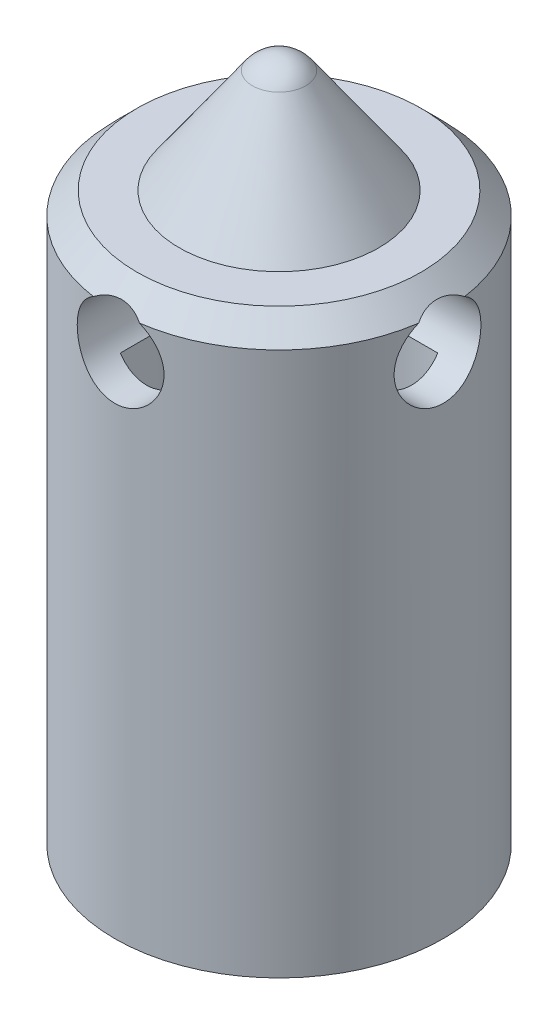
ISO-10303-21;
HEADER;
FILE_DESCRIPTION(('STEP AP214'),'2;1');
FILE_NAME('part.step','',(''),(''),'','','');
FILE_SCHEMA(('AUTOMOTIVE_DESIGN { 1 0 10303 214 1 1 1 1 }'));
ENDSEC;
DATA;
#1=APPLICATION_CONTEXT('core data for automotive mechanical design processes');
#2=APPLICATION_PROTOCOL_DEFINITION('international standard','automotive_design',2000,#1);
#3=PRODUCT_CONTEXT('',#1,'mechanical');
#4=PRODUCT('Part','Part','',(#3));
#5=PRODUCT_RELATED_PRODUCT_CATEGORY('part','',(#4));
#6=PRODUCT_DEFINITION_FORMATION('','',#4);
#7=PRODUCT_DEFINITION_CONTEXT('part definition',#1,'design');
#8=PRODUCT_DEFINITION('design','',#6,#7);
#9=PRODUCT_DEFINITION_SHAPE('','',#8);
#10=(LENGTH_UNIT() NAMED_UNIT(*) SI_UNIT(.MILLI.,.METRE.));
#11=(NAMED_UNIT(*) PLANE_ANGLE_UNIT() SI_UNIT($,.RADIAN.));
#12=(NAMED_UNIT(*) SI_UNIT($,.STERADIAN.) SOLID_ANGLE_UNIT());
#13=UNCERTAINTY_MEASURE_WITH_UNIT(LENGTH_MEASURE(1.E-05),#10,'distance_accuracy_value','');
#14=(GEOMETRIC_REPRESENTATION_CONTEXT(3) GLOBAL_UNCERTAINTY_ASSIGNED_CONTEXT((#13)) GLOBAL_UNIT_ASSIGNED_CONTEXT((#10,
#11,#12)) REPRESENTATION_CONTEXT('',''));
#15=CARTESIAN_POINT('',(0.,0.,0.));
#16=DIRECTION('',(0.,0.,1.));
#17=DIRECTION('',(1.,0.,0.));
#18=AXIS2_PLACEMENT_3D('',#15,#16,#17);
#19=CARTESIAN_POINT('',(2.4257,8.6868,0.));
#20=DIRECTION('',(0.,-1.,0.));
#21=DIRECTION('',(0.,0.,-1.));
#22=AXIS2_PLACEMENT_3D('',#19,#20,#21);
#23=PLANE('',#22);
#24=DIRECTION('',(1.,0.,0.));
#25=VECTOR('',#24,1.);
#26=CARTESIAN_POINT('',(-5.,8.6868,-0.537354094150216));
#27=LINE('',#26,#25);
#28=CARTESIAN_POINT('',(0.537354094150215,8.6868,-0.537354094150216));
#29=VERTEX_POINT('',#28);
#30=CARTESIAN_POINT('',(2.36543253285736,8.6868,-0.537354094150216));
#31=VERTEX_POINT('',#30);
#32=EDGE_CURVE('E283',#29,#31,#27,.T.);
#33=ORIENTED_EDGE('',*,*,#32,.F.);
#34=DIRECTION('',(0.,0.,1.));
#35=VECTOR('',#34,1.);
#36=CARTESIAN_POINT('',(0.537354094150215,8.6868,-5.));
#37=LINE('',#36,#35);
#38=CARTESIAN_POINT('',(0.537354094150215,8.6868,-2.36543253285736));
#39=VERTEX_POINT('',#38);
#40=EDGE_CURVE('E152',#39,#29,#37,.T.);
#41=ORIENTED_EDGE('',*,*,#40,.F.);
#42=CARTESIAN_POINT('',(0.,8.6868,0.));
#43=DIRECTION('',(0.,1.,0.));
#44=DIRECTION('',(0.,0.,1.));
#45=AXIS2_PLACEMENT_3D('',#42,#43,#44);
#46=CIRCLE('',#45,2.4257);
#47=EDGE_CURVE('E192',#31,#39,#46,.T.);
#48=ORIENTED_EDGE('',*,*,#47,.F.);
#49=EDGE_LOOP('',(#33,#41,#48));
#50=FACE_BOUND('',#49,.T.);
#51=ADVANCED_FACE('F54',(#50),#23,.T.);
#52=DIRECTION('',(1.,0.,0.));
#53=VECTOR('',#52,1.);
#54=CARTESIAN_POINT('',(-5.,8.6868,-0.537354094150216));
#55=LINE('',#54,#53);
#56=CARTESIAN_POINT('',(-2.36543253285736,8.6868,-0.537354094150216));
#57=VERTEX_POINT('',#56);
#58=CARTESIAN_POINT('',(-0.537354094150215,8.6868,-0.537354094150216));
#59=VERTEX_POINT('',#58);
#60=EDGE_CURVE('E138',#57,#59,#55,.T.);
#61=ORIENTED_EDGE('',*,*,#60,.F.);
#62=CARTESIAN_POINT('',(-0.537354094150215,8.6868,-2.36543253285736));
#63=VERTEX_POINT('',#62);
#64=EDGE_CURVE('E193',#63,#57,#46,.T.);
#65=ORIENTED_EDGE('',*,*,#64,.F.);
#66=DIRECTION('',(0.,0.,1.));
#67=VECTOR('',#66,1.);
#68=CARTESIAN_POINT('',(-0.537354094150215,8.6868,-5.));
#69=LINE('',#68,#67);
#70=EDGE_CURVE('E167',#59,#63,#69,.F.);
#71=ORIENTED_EDGE('',*,*,#70,.F.);
#72=EDGE_LOOP('',(#61,#65,#71));
#73=FACE_BOUND('',#72,.T.);
#74=ADVANCED_FACE('F320',(#73),#23,.T.);
#75=CARTESIAN_POINT('',(0.,9.271,-5.));
#76=DIRECTION('',(0.,0.,1.));
#77=DIRECTION('',(1.,0.,0.));
#78=AXIS2_PLACEMENT_3D('',#75,#76,#77);
#79=CYLINDRICAL_SURFACE('',#78,0.793749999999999);
#80=CARTESIAN_POINT('',(-0.439700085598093,9.93183500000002,2.98358910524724));
#81=CARTESIAN_POINT('',(-0.410241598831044,9.95148901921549,2.96807129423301));
#82=CARTESIAN_POINT('',(-0.378793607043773,9.96951383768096,2.95411745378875));
#83=CARTESIAN_POINT('',(-0.312571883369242,10.0015312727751,2.92965766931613));
#84=CARTESIAN_POINT('',(-0.277790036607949,10.0155137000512,2.9191604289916));
#85=CARTESIAN_POINT('',(-0.205584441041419,10.0386058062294,2.90198539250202));
#86=CARTESIAN_POINT('',(-0.168152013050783,10.0476985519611,2.89532086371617));
#87=CARTESIAN_POINT('',(-0.0919301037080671,10.0603517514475,2.88608176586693));
#88=CARTESIAN_POINT('',(-0.0531429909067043,10.063921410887,2.88350039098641));
#89=CARTESIAN_POINT('',(0.022494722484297,10.0652840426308,2.88251306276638));
#90=CARTESIAN_POINT('',(0.0593374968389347,10.0633768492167,2.88389039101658));
#91=CARTESIAN_POINT('',(0.13210736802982,10.0545372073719,2.89032273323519));
#92=CARTESIAN_POINT('',(0.168033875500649,10.0476016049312,2.89538005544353));
#93=CARTESIAN_POINT('',(0.237631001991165,10.0291923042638,2.90896738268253));
#94=CARTESIAN_POINT('',(0.271319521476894,10.0177614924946,2.91746459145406));
#95=CARTESIAN_POINT('',(0.3360064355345,9.9909734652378,2.93768725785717));
#96=CARTESIAN_POINT('',(0.367007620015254,9.97562038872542,2.94940931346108));
#97=CARTESIAN_POINT('',(0.411261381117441,9.9501171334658,2.96921862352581));
#98=CARTESIAN_POINT('',(0.425700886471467,9.94115539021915,2.97623132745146));
#99=CARTESIAN_POINT('',(0.439700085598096,9.93183500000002,2.98358910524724));
#100=B_SPLINE_CURVE_WITH_KNOTS('',3,(#80,#81,#82,#83,#84,#85,#86,#87,#88,#89,#90,#91,#92,#93,
#94,#95,#96,#97,#98,#99),.UNSPECIFIED.,.F.,.F.,(4,2,2,2,2,2,2,2,2,4),(0.,0.115971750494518,
0.232233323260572,0.348894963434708,0.465361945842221,0.575576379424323,0.685860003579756,
0.795116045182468,0.904257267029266,0.959351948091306),.UNSPECIFIED.);
#101=CARTESIAN_POINT('',(-0.420684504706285,9.94410000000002,2.97394303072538));
#102=VERTEX_POINT('',#101);
#103=CARTESIAN_POINT('',(0.420684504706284,9.94410000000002,2.97394303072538));
#104=VERTEX_POINT('',#103);
#105=EDGE_CURVE('E202',#102,#104,#100,.T.);
#106=ORIENTED_EDGE('',*,*,#105,.F.);
#107=CARTESIAN_POINT('',(0.420684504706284,9.94410000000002,2.97394303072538));
#108=CARTESIAN_POINT('',(0.458832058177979,9.92029056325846,2.96855665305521));
#109=CARTESIAN_POINT('',(0.494863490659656,9.89323433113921,2.96270051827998));
#110=CARTESIAN_POINT('',(0.561846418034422,9.83346833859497,2.95072611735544));
#111=CARTESIAN_POINT('',(0.592797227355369,9.80075781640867,2.94460781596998));
#112=CARTESIAN_POINT('',(0.648772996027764,9.73051445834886,2.93278563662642));
#113=CARTESIAN_POINT('',(0.673795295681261,9.69297946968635,2.92708194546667));
#114=CARTESIAN_POINT('',(0.717171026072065,9.6141146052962,2.91675781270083));
#115=CARTESIAN_POINT('',(0.735527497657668,9.57278647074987,2.91213687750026));
#116=CARTESIAN_POINT('',(0.764836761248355,9.48792691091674,2.90457675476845));
#117=CARTESIAN_POINT('',(0.775866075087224,9.44442353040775,2.90162023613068));
#118=CARTESIAN_POINT('',(0.79044397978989,9.3560896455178,2.89768344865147));
#119=CARTESIAN_POINT('',(0.793993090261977,9.31125923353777,2.89670304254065));
#120=CARTESIAN_POINT('',(0.79348903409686,9.22307643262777,2.89684086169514));
#121=CARTESIAN_POINT('',(0.789674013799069,9.17972237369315,2.89789334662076));
#122=CARTESIAN_POINT('',(0.77504515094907,9.09430340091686,2.9018397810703));
#123=CARTESIAN_POINT('',(0.764231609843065,9.05223843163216,2.90473365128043));
#124=CARTESIAN_POINT('',(0.735975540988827,8.9705942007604,2.91202050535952));
#125=CARTESIAN_POINT('',(0.718540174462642,8.93101230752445,2.91641186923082));
#126=CARTESIAN_POINT('',(0.677552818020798,8.85528893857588,2.92620524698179));
#127=CARTESIAN_POINT('',(0.653999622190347,8.8191481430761,2.93160746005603));
#128=CARTESIAN_POINT('',(0.600579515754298,8.75012927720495,2.94302292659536));
#129=CARTESIAN_POINT('',(0.570538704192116,8.71738800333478,2.94904997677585));
#130=CARTESIAN_POINT('',(0.50540072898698,8.65734570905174,2.96090812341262));
#131=CARTESIAN_POINT('',(0.470303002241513,8.6300452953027,2.96673919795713));
#132=CARTESIAN_POINT('',(0.395370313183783,8.58125322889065,2.97765819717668));
#133=CARTESIAN_POINT('',(0.355470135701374,8.55985857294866,2.98273314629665));
#134=CARTESIAN_POINT('',(0.272482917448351,8.52411837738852,2.99145511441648));
#135=CARTESIAN_POINT('',(0.229396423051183,8.50977163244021,2.99510237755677));
#136=CARTESIAN_POINT('',(0.142289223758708,8.48885314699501,3.00048776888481));
#137=CARTESIAN_POINT('',(0.0983114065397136,8.48211359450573,3.00226703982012));
#138=CARTESIAN_POINT('',(0.00981567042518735,8.47607303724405,3.003859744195));
#139=CARTESIAN_POINT('',(-0.0347021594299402,8.47677082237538,3.00367349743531));
#140=CARTESIAN_POINT('',(-0.121846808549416,8.48546658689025,3.00138636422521));
#141=CARTESIAN_POINT('',(-0.16449315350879,8.4932832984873,2.99933302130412));
#142=CARTESIAN_POINT('',(-0.247845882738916,8.51570242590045,2.99359839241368));
#143=CARTESIAN_POINT('',(-0.288552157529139,8.530305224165,2.98991701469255));
#144=CARTESIAN_POINT('',(-0.367334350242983,8.56602215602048,2.98126908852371));
#145=CARTESIAN_POINT('',(-0.405380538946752,8.58719877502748,2.97629028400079));
#146=CARTESIAN_POINT('',(-0.477441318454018,8.63541431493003,2.96558450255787));
#147=CARTESIAN_POINT('',(-0.511455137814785,8.662454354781,2.95985738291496));
#148=CARTESIAN_POINT('',(-0.575567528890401,8.722592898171,2.94807230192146));
#149=CARTESIAN_POINT('',(-0.605517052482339,8.75584954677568,2.94200957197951));
#150=CARTESIAN_POINT('',(-0.659449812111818,8.82697628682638,2.9303927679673));
#151=CARTESIAN_POINT('',(-0.683432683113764,8.86484666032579,2.92483872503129));
#152=CARTESIAN_POINT('',(-0.724861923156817,8.94444424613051,2.91484934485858));
#153=CARTESIAN_POINT('',(-0.742268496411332,8.98619309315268,2.91042087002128));
#154=CARTESIAN_POINT('',(-0.769767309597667,9.07217070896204,2.9032697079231));
#155=CARTESIAN_POINT('',(-0.779861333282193,9.11639887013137,2.90054660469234));
#156=CARTESIAN_POINT('',(-0.792193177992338,9.20468799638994,2.89720253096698));
#157=CARTESIAN_POINT('',(-0.794652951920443,9.24871574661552,2.89652219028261));
#158=CARTESIAN_POINT('',(-0.792257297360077,9.33655214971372,2.89717837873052));
#159=CARTESIAN_POINT('',(-0.787402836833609,9.38036083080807,2.89851464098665));
#160=CARTESIAN_POINT('',(-0.77071367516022,9.46566192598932,2.9029958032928));
#161=CARTESIAN_POINT('',(-0.759012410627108,9.50718244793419,2.90610610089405));
#162=CARTESIAN_POINT('',(-0.729106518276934,9.58768128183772,2.91375235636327));
#163=CARTESIAN_POINT('',(-0.710899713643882,9.62665873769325,2.91828879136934));
#164=CARTESIAN_POINT('',(-0.668043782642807,9.70189833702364,2.92839962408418));
#165=CARTESIAN_POINT('',(-0.643261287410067,9.73808152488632,2.93399472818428));
#166=CARTESIAN_POINT('',(-0.588130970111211,9.8058313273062,2.94553956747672));
#167=CARTESIAN_POINT('',(-0.557788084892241,9.83740199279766,2.95148898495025));
#168=CARTESIAN_POINT('',(-0.508776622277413,9.8806387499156,2.96019151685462));
#169=CARTESIAN_POINT('',(-0.491886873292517,9.89434551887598,2.96305096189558));
#170=CARTESIAN_POINT('',(-0.457055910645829,9.9203146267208,2.96862316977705));
#171=CARTESIAN_POINT('',(-0.439116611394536,9.93257947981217,2.97133618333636));
#172=CARTESIAN_POINT('',(-0.420684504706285,9.94410000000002,2.97394303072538));
#173=B_SPLINE_CURVE_WITH_KNOTS('',3,(#107,#108,#109,#110,#111,#112,#113,#114,#115,#116,#117,
#118,#119,#120,#121,#122,#123,#124,#125,#126,#127,#128,#129,#130,#131,#132,#133,#134,#135,#136,
#137,#138,#139,#140,#141,#142,#143,#144,#145,#146,#147,#148,#149,#150,#151,#152,#153,#154,#155,
#156,#157,#158,#159,#160,#161,#162,#163,#164,#165,#166,#167,#168,#169,#170,#171,#172),
.UNSPECIFIED.,.F.,.F.,(4,2,2,2,2,2,2,2,2,2,2,2,2,2,2,2,2,2,2,2,2,2,2,2,2,2,2,2,2,2,2,2,4),(0.,
0.135680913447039,0.271380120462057,0.407140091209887,0.54283805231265,0.677095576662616,
0.811343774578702,0.9413231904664,1.07129700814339,1.20113066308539,1.33098992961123,
1.46489653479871,1.59881806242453,1.73482346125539,1.87080559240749,2.00372550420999,
2.13662378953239,2.26622993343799,2.39584338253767,2.5267286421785,2.65763890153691,
2.79249794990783,2.92736524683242,3.06303608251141,3.19867381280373,3.33032929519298,
3.46196735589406,3.59112157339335,3.72031904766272,3.8523691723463,3.98430261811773,
4.05005604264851,4.11569305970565),.UNSPECIFIED.);
#174=EDGE_CURVE('E194',#104,#102,#173,.T.);
#175=ORIENTED_EDGE('',*,*,#174,.F.);
#176=EDGE_LOOP('',(#106,#175));
#177=FACE_BOUND('',#176,.T.);
#178=CARTESIAN_POINT('',(-0.537354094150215,8.6868,2.36543253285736));
#179=VERTEX_POINT('',#178);
#180=CARTESIAN_POINT('',(-0.537354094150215,8.6868,0.537354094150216));
#181=VERTEX_POINT('',#180);
#182=EDGE_CURVE('E158',#179,#181,#69,.F.);
#183=ORIENTED_EDGE('',*,*,#182,.T.);
#184=CARTESIAN_POINT('',(0.,9.271,0.));
#185=DIRECTION('',(0.707106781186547,0.,0.707106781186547));
#186=DIRECTION('',(-0.707106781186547,0.,0.707106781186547));
#187=AXIS2_PLACEMENT_3D('',#184,#185,#186);
#188=ELLIPSE('',#187,1.12253201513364,0.793749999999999);
#189=CARTESIAN_POINT('',(0.,10.06475,0.));
#190=VERTEX_POINT('',#189);
#191=EDGE_CURVE('E12',#181,#190,#188,.F.);
#192=ORIENTED_EDGE('',*,*,#191,.T.);
#193=CARTESIAN_POINT('',(0.,9.271,0.));
#194=DIRECTION('',(-0.707106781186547,0.,0.707106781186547));
#195=DIRECTION('',(0.707106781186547,0.,0.707106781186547));
#196=AXIS2_PLACEMENT_3D('',#193,#194,#195);
#197=ELLIPSE('',#196,1.12253201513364,0.793749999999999);
#198=CARTESIAN_POINT('',(0.537354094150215,8.6868,0.537354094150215));
#199=VERTEX_POINT('',#198);
#200=EDGE_CURVE('E142',#190,#199,#197,.F.);
#201=ORIENTED_EDGE('',*,*,#200,.T.);
#202=CARTESIAN_POINT('',(0.537354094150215,8.6868,2.36543253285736));
#203=VERTEX_POINT('',#202);
#204=EDGE_CURVE('E165',#199,#203,#37,.T.);
#205=ORIENTED_EDGE('',*,*,#204,.T.);
#206=CARTESIAN_POINT('',(0.537354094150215,8.6868,2.36543253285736));
#207=CARTESIAN_POINT('',(0.505018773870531,8.65701865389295,2.37280151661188));
#208=CARTESIAN_POINT('',(0.470140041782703,8.62993647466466,2.38000610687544));
#209=CARTESIAN_POINT('',(0.396210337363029,8.5818029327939,2.39341184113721));
#210=CARTESIAN_POINT('',(0.357154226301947,8.56075911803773,2.39961172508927));
#211=CARTESIAN_POINT('',(0.275803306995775,8.52538339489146,2.41032036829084));
#212=CARTESIAN_POINT('',(0.233503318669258,8.51106249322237,2.41482635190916));
#213=CARTESIAN_POINT('',(0.146971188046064,8.48970572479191,2.42163114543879));
#214=CARTESIAN_POINT('',(0.102741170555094,8.48266204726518,2.42393232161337));
#215=CARTESIAN_POINT('',(0.0151361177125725,8.47621972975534,2.42603561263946));
#216=CARTESIAN_POINT('',(-0.0282191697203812,8.47657718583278,2.42591745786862));
#217=CARTESIAN_POINT('',(-0.114243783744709,8.4843280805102,2.42339035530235));
#218=CARTESIAN_POINT('',(-0.156912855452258,8.49172407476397,2.42098057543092));
#219=CARTESIAN_POINT('',(-0.239711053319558,8.51312073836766,2.41417937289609));
#220=CARTESIAN_POINT('',(-0.279868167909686,8.52702339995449,2.40981739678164));
#221=CARTESIAN_POINT('',(-0.357281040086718,8.56094869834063,2.3995612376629));
#222=CARTESIAN_POINT('',(-0.394538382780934,8.58096796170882,2.3936678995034));
#223=CARTESIAN_POINT('',(-0.44899833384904,8.61605139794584,2.38386245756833));
#224=CARTESIAN_POINT('',(-0.467549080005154,8.6291651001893,2.38028441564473));
#225=CARTESIAN_POINT('',(-0.50340029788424,8.6568836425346,2.37296071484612));
#226=CARTESIAN_POINT('',(-0.520703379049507,8.67148520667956,2.36921543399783));
#227=CARTESIAN_POINT('',(-0.537354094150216,8.6868,2.36543253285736));
#228=B_SPLINE_CURVE_WITH_KNOTS('',3,(#206,#207,#208,#209,#210,#211,#212,#213,#214,#215,#216,
#217,#218,#219,#220,#221,#222,#223,#224,#225,#226,#227),.UNSPECIFIED.,.F.,.F.,(4,2,2,2,2,2,2,2,
2,2,4),(0.,0.133597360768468,0.267360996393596,0.40134287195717,0.535180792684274,
0.664615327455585,0.794096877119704,0.921687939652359,1.04920875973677,1.11812937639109,
1.18690139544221),.UNSPECIFIED.);
#229=EDGE_CURVE('E221',#203,#179,#228,.T.);
#230=ORIENTED_EDGE('',*,*,#229,.T.);
#231=EDGE_LOOP('',(#183,#192,#201,#205,#230));
#232=FACE_BOUND('',#231,.T.);
#233=ADVANCED_FACE('F155',(#177,#232),#79,.F.);
#234=DIRECTION('',(1.,0.,0.));
#235=VECTOR('',#234,1.);
#236=CARTESIAN_POINT('',(-5.,8.6868,0.537354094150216));
#237=LINE('',#236,#235);
#238=CARTESIAN_POINT('',(2.36543253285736,8.6868,0.537354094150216));
#239=VERTEX_POINT('',#238);
#240=EDGE_CURVE('E149',#239,#199,#237,.F.);
#241=ORIENTED_EDGE('',*,*,#240,.F.);
#242=EDGE_CURVE('E189',#203,#239,#46,.T.);
#243=ORIENTED_EDGE('',*,*,#242,.F.);
#244=ORIENTED_EDGE('',*,*,#204,.F.);
#245=EDGE_LOOP('',(#241,#243,#244));
#246=FACE_BOUND('',#245,.T.);
#247=ADVANCED_FACE('F318',(#246),#23,.T.);
#248=CARTESIAN_POINT('',(0.,0.,0.));
#249=DIRECTION('',(0.,1.,0.));
#250=DIRECTION('',(0.,0.,1.));
#251=AXIS2_PLACEMENT_3D('',#248,#249,#250);
#252=PLANE('',#251);
#253=CARTESIAN_POINT('',(0.,0.,0.));
#254=DIRECTION('',(0.,1.,0.));
#255=DIRECTION('',(0.,0.,1.));
#256=AXIS2_PLACEMENT_3D('',#253,#254,#255);
#257=CIRCLE('',#256,3.00355);
#258=CARTESIAN_POINT('',(0.,0.,3.00355));
#259=VERTEX_POINT('',#258);
#260=EDGE_CURVE('E168',#259,#259,#257,.T.);
#261=ORIENTED_EDGE('',*,*,#260,.F.);
#262=EDGE_LOOP('',(#261));
#263=FACE_BOUND('',#262,.T.);
#264=CARTESIAN_POINT('',(0.,0.,0.));
#265=DIRECTION('',(0.,1.,0.));
#266=DIRECTION('',(0.,0.,1.));
#267=AXIS2_PLACEMENT_3D('',#264,#265,#266);
#268=CIRCLE('',#267,2.4257);
#269=CARTESIAN_POINT('',(0.,0.,2.4257));
#270=VERTEX_POINT('',#269);
#271=EDGE_CURVE('E186',#270,#270,#268,.T.);
#272=ORIENTED_EDGE('',*,*,#271,.T.);
#273=EDGE_LOOP('',(#272));
#274=FACE_BOUND('',#273,.T.);
#275=ADVANCED_FACE('F56',(#263,#274),#252,.F.);
#276=CARTESIAN_POINT('',(0.,13.6030493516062,0.));
#277=DIRECTION('',(0.,1.,0.));
#278=DIRECTION('',(0.,0.,1.));
#279=AXIS2_PLACEMENT_3D('',#276,#277,#278);
#280=CYLINDRICAL_SURFACE('',#279,3.00355);
#281=CARTESIAN_POINT('',(0.,9.94410000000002,0.));
#282=DIRECTION('',(0.,1.,0.));
#283=DIRECTION('',(0.,0.,1.));
#284=AXIS2_PLACEMENT_3D('',#281,#282,#283);
#285=CIRCLE('',#284,3.00355);
#286=CARTESIAN_POINT('',(-2.97394303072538,9.94410000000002,0.420684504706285));
#287=VERTEX_POINT('',#286);
#288=EDGE_CURVE('E179',#287,#102,#285,.T.);
#289=ORIENTED_EDGE('',*,*,#288,.F.);
#290=CARTESIAN_POINT('',(-2.97394303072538,9.94410000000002,0.420684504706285));
#291=CARTESIAN_POINT('',(-2.96855665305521,9.92029056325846,0.458832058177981));
#292=CARTESIAN_POINT('',(-2.96270051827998,9.89323433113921,0.494863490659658));
#293=CARTESIAN_POINT('',(-2.95072611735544,9.83346833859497,0.561846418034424));
#294=CARTESIAN_POINT('',(-2.94460781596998,9.80075781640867,0.59279722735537));
#295=CARTESIAN_POINT('',(-2.93278563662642,9.73051445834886,0.648772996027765));
#296=CARTESIAN_POINT('',(-2.92708194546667,9.69297946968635,0.673795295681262));
#297=CARTESIAN_POINT('',(-2.91675781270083,9.6141146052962,0.717171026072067));
#298=CARTESIAN_POINT('',(-2.91213687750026,9.57278647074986,0.735527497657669));
#299=CARTESIAN_POINT('',(-2.90457675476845,9.48792691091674,0.764836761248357));
#300=CARTESIAN_POINT('',(-2.90162023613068,9.44442353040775,0.775866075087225));
#301=CARTESIAN_POINT('',(-2.89768344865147,9.3560896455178,0.790443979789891));
#302=CARTESIAN_POINT('',(-2.89670304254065,9.31125923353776,0.793993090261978));
#303=CARTESIAN_POINT('',(-2.89684086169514,9.22307643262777,0.793489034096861));
#304=CARTESIAN_POINT('',(-2.89789334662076,9.17972237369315,0.78967401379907));
#305=CARTESIAN_POINT('',(-2.9018397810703,9.09430340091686,0.77504515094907));
#306=CARTESIAN_POINT('',(-2.90473365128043,9.05223843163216,0.764231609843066));
#307=CARTESIAN_POINT('',(-2.91202050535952,8.9705942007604,0.735975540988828));
#308=CARTESIAN_POINT('',(-2.91641186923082,8.93101230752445,0.718540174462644));
#309=CARTESIAN_POINT('',(-2.92620524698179,8.85528893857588,0.677552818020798));
#310=CARTESIAN_POINT('',(-2.93160746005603,8.8191481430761,0.653999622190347));
#311=CARTESIAN_POINT('',(-2.94302292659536,8.75012927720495,0.600579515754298));
#312=CARTESIAN_POINT('',(-2.94904997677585,8.71738800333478,0.570538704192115));
#313=CARTESIAN_POINT('',(-2.96090812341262,8.65734570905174,0.505400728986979));
#314=CARTESIAN_POINT('',(-2.96673919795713,8.6300452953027,0.470303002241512));
#315=CARTESIAN_POINT('',(-2.97765819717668,8.58125322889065,0.395370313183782));
#316=CARTESIAN_POINT('',(-2.98273314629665,8.55985857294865,0.355470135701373));
#317=CARTESIAN_POINT('',(-2.99145511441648,8.52411837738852,0.27248291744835));
#318=CARTESIAN_POINT('',(-2.99510237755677,8.50977163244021,0.229396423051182));
#319=CARTESIAN_POINT('',(-3.00048776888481,8.48885314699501,0.142289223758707));
#320=CARTESIAN_POINT('',(-3.00226703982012,8.48211359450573,0.0983114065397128));
#321=CARTESIAN_POINT('',(-3.003859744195,8.47607303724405,0.00981567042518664));
#322=CARTESIAN_POINT('',(-3.00367349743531,8.47677082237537,-0.0347021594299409));
#323=CARTESIAN_POINT('',(-3.00138636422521,8.48546658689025,-0.121846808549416));
#324=CARTESIAN_POINT('',(-2.99933302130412,8.49328329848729,-0.164493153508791));
#325=CARTESIAN_POINT('',(-2.99359839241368,8.51570242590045,-0.247845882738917));
#326=CARTESIAN_POINT('',(-2.98991701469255,8.530305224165,-0.288552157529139));
#327=CARTESIAN_POINT('',(-2.98126908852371,8.56602215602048,-0.367334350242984));
#328=CARTESIAN_POINT('',(-2.97629028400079,8.58719877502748,-0.405380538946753));
#329=CARTESIAN_POINT('',(-2.96558450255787,8.63541431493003,-0.477441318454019));
#330=CARTESIAN_POINT('',(-2.95985738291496,8.662454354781,-0.511455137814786));
#331=CARTESIAN_POINT('',(-2.94807230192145,8.722592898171,-0.575567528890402));
#332=CARTESIAN_POINT('',(-2.94200957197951,8.75584954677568,-0.60551705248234));
#333=CARTESIAN_POINT('',(-2.9303927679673,8.82697628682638,-0.659449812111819));
#334=CARTESIAN_POINT('',(-2.92483872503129,8.86484666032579,-0.683432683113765));
#335=CARTESIAN_POINT('',(-2.91484934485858,8.94444424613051,-0.724861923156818));
#336=CARTESIAN_POINT('',(-2.91042087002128,8.98619309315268,-0.742268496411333));
#337=CARTESIAN_POINT('',(-2.9032697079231,9.07217070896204,-0.769767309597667));
#338=CARTESIAN_POINT('',(-2.90054660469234,9.11639887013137,-0.779861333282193));
#339=CARTESIAN_POINT('',(-2.89720253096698,9.20468799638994,-0.792193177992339));
#340=CARTESIAN_POINT('',(-2.89652219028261,9.24871574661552,-0.794652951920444));
#341=CARTESIAN_POINT('',(-2.89717837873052,9.33655214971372,-0.792257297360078));
#342=CARTESIAN_POINT('',(-2.89851464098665,9.38036083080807,-0.78740283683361));
#343=CARTESIAN_POINT('',(-2.9029958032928,9.46566192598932,-0.770713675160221));
#344=CARTESIAN_POINT('',(-2.90610610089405,9.50718244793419,-0.759012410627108));
#345=CARTESIAN_POINT('',(-2.91375235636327,9.58768128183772,-0.729106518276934));
#346=CARTESIAN_POINT('',(-2.91828879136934,9.62665873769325,-0.710899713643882));
#347=CARTESIAN_POINT('',(-2.92839962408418,9.70189833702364,-0.668043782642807));
#348=CARTESIAN_POINT('',(-2.93399472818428,9.73808152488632,-0.643261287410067));
#349=CARTESIAN_POINT('',(-2.94553956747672,9.8058313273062,-0.588130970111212));
#350=CARTESIAN_POINT('',(-2.95148898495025,9.83740199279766,-0.557788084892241));
#351=CARTESIAN_POINT('',(-2.96019151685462,9.8806387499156,-0.508776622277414));
#352=CARTESIAN_POINT('',(-2.96305096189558,9.89434551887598,-0.491886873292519));
#353=CARTESIAN_POINT('',(-2.96862316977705,9.9203146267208,-0.45705591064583));
#354=CARTESIAN_POINT('',(-2.97133618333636,9.93257947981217,-0.439116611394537));
#355=CARTESIAN_POINT('',(-2.97394303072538,9.94410000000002,-0.420684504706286));
#356=B_SPLINE_CURVE_WITH_KNOTS('',3,(#290,#291,#292,#293,#294,#295,#296,#297,#298,#299,#300,
#301,#302,#303,#304,#305,#306,#307,#308,#309,#310,#311,#312,#313,#314,#315,#316,#317,#318,#319,
#320,#321,#322,#323,#324,#325,#326,#327,#328,#329,#330,#331,#332,#333,#334,#335,#336,#337,#338,
#339,#340,#341,#342,#343,#344,#345,#346,#347,#348,#349,#350,#351,#352,#353,#354,#355),
.UNSPECIFIED.,.F.,.F.,(4,2,2,2,2,2,2,2,2,2,2,2,2,2,2,2,2,2,2,2,2,2,2,2,2,2,2,2,2,2,2,2,4),(0.,
0.13568091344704,0.271380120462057,0.407140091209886,0.542838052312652,0.677095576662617,
0.811343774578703,0.9413231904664,1.07129700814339,1.20113066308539,1.33098992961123,
1.46489653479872,1.59881806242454,1.73482346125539,1.87080559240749,2.00372550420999,
2.13662378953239,2.26622993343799,2.39584338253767,2.5267286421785,2.65763890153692,
2.79249794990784,2.92736524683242,3.06303608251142,3.19867381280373,3.33032929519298,
3.46196735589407,3.59112157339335,3.72031904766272,3.85236917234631,3.98430261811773,
4.05005604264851,4.11569305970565),.UNSPECIFIED.);
#357=CARTESIAN_POINT('',(-2.97394303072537,9.94410000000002,-0.420684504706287));
#358=VERTEX_POINT('',#357);
#359=EDGE_CURVE('E75',#287,#358,#356,.T.);
#360=ORIENTED_EDGE('',*,*,#359,.T.);
#361=CARTESIAN_POINT('',(-0.420684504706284,9.94410000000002,-2.97394303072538));
#362=VERTEX_POINT('',#361);
#363=EDGE_CURVE('E175',#362,#358,#285,.T.);
#364=ORIENTED_EDGE('',*,*,#363,.F.);
#365=CARTESIAN_POINT('',(-0.420684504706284,9.94410000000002,-2.97394303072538));
#366=CARTESIAN_POINT('',(-0.458832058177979,9.92029056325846,-2.96855665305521));
#367=CARTESIAN_POINT('',(-0.494863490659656,9.89323433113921,-2.96270051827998));
#368=CARTESIAN_POINT('',(-0.561846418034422,9.83346833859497,-2.95072611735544));
#369=CARTESIAN_POINT('',(-0.592797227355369,9.80075781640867,-2.94460781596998));
#370=CARTESIAN_POINT('',(-0.648772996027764,9.73051445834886,-2.93278563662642));
#371=CARTESIAN_POINT('',(-0.673795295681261,9.69297946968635,-2.92708194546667));
#372=CARTESIAN_POINT('',(-0.717171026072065,9.6141146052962,-2.91675781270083));
#373=CARTESIAN_POINT('',(-0.735527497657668,9.57278647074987,-2.91213687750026));
#374=CARTESIAN_POINT('',(-0.764836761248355,9.48792691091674,-2.90457675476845));
#375=CARTESIAN_POINT('',(-0.775866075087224,9.44442353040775,-2.90162023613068));
#376=CARTESIAN_POINT('',(-0.79044397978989,9.3560896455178,-2.89768344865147));
#377=CARTESIAN_POINT('',(-0.793993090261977,9.31125923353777,-2.89670304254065));
#378=CARTESIAN_POINT('',(-0.79348903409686,9.22307643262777,-2.89684086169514));
#379=CARTESIAN_POINT('',(-0.789674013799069,9.17972237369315,-2.89789334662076));
#380=CARTESIAN_POINT('',(-0.77504515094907,9.09430340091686,-2.9018397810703));
#381=CARTESIAN_POINT('',(-0.764231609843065,9.05223843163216,-2.90473365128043));
#382=CARTESIAN_POINT('',(-0.735975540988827,8.9705942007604,-2.91202050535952));
#383=CARTESIAN_POINT('',(-0.718540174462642,8.93101230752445,-2.91641186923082));
#384=CARTESIAN_POINT('',(-0.677552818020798,8.85528893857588,-2.92620524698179));
#385=CARTESIAN_POINT('',(-0.653999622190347,8.8191481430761,-2.93160746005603));
#386=CARTESIAN_POINT('',(-0.600579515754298,8.75012927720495,-2.94302292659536));
#387=CARTESIAN_POINT('',(-0.570538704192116,8.71738800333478,-2.94904997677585));
#388=CARTESIAN_POINT('',(-0.50540072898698,8.65734570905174,-2.96090812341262));
#389=CARTESIAN_POINT('',(-0.470303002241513,8.6300452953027,-2.96673919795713));
#390=CARTESIAN_POINT('',(-0.395370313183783,8.58125322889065,-2.97765819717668));
#391=CARTESIAN_POINT('',(-0.355470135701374,8.55985857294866,-2.98273314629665));
#392=CARTESIAN_POINT('',(-0.272482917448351,8.52411837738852,-2.99145511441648));
#393=CARTESIAN_POINT('',(-0.229396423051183,8.50977163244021,-2.99510237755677));
#394=CARTESIAN_POINT('',(-0.142289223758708,8.48885314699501,-3.00048776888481));
#395=CARTESIAN_POINT('',(-0.0983114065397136,8.48211359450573,-3.00226703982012));
#396=CARTESIAN_POINT('',(-0.00981567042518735,8.47607303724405,-3.003859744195));
#397=CARTESIAN_POINT('',(0.0347021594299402,8.47677082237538,-3.00367349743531));
#398=CARTESIAN_POINT('',(0.121846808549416,8.48546658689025,-3.00138636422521));
#399=CARTESIAN_POINT('',(0.16449315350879,8.4932832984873,-2.99933302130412));
#400=CARTESIAN_POINT('',(0.247845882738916,8.51570242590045,-2.99359839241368));
#401=CARTESIAN_POINT('',(0.288552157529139,8.530305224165,-2.98991701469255));
#402=CARTESIAN_POINT('',(0.367334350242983,8.56602215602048,-2.98126908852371));
#403=CARTESIAN_POINT('',(0.405380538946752,8.58719877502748,-2.97629028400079));
#404=CARTESIAN_POINT('',(0.477441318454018,8.63541431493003,-2.96558450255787));
#405=CARTESIAN_POINT('',(0.511455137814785,8.662454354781,-2.95985738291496));
#406=CARTESIAN_POINT('',(0.575567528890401,8.722592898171,-2.94807230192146));
#407=CARTESIAN_POINT('',(0.605517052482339,8.75584954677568,-2.94200957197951));
#408=CARTESIAN_POINT('',(0.659449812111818,8.82697628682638,-2.9303927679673));
#409=CARTESIAN_POINT('',(0.683432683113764,8.86484666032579,-2.92483872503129));
#410=CARTESIAN_POINT('',(0.724861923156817,8.94444424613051,-2.91484934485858));
#411=CARTESIAN_POINT('',(0.742268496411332,8.98619309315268,-2.91042087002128));
#412=CARTESIAN_POINT('',(0.769767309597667,9.07217070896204,-2.9032697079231));
#413=CARTESIAN_POINT('',(0.779861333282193,9.11639887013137,-2.90054660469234));
#414=CARTESIAN_POINT('',(0.792193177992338,9.20468799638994,-2.89720253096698));
#415=CARTESIAN_POINT('',(0.794652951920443,9.24871574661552,-2.89652219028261));
#416=CARTESIAN_POINT('',(0.792257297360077,9.33655214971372,-2.89717837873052));
#417=CARTESIAN_POINT('',(0.787402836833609,9.38036083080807,-2.89851464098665));
#418=CARTESIAN_POINT('',(0.77071367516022,9.46566192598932,-2.9029958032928));
#419=CARTESIAN_POINT('',(0.759012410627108,9.50718244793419,-2.90610610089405));
#420=CARTESIAN_POINT('',(0.729106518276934,9.58768128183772,-2.91375235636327));
#421=CARTESIAN_POINT('',(0.710899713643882,9.62665873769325,-2.91828879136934));
#422=CARTESIAN_POINT('',(0.668043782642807,9.70189833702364,-2.92839962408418));
#423=CARTESIAN_POINT('',(0.643261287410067,9.73808152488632,-2.93399472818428));
#424=CARTESIAN_POINT('',(0.588130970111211,9.8058313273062,-2.94553956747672));
#425=CARTESIAN_POINT('',(0.557788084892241,9.83740199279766,-2.95148898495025));
#426=CARTESIAN_POINT('',(0.508776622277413,9.8806387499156,-2.96019151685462));
#427=CARTESIAN_POINT('',(0.491886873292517,9.89434551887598,-2.96305096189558));
#428=CARTESIAN_POINT('',(0.457055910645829,9.9203146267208,-2.96862316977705));
#429=CARTESIAN_POINT('',(0.439116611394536,9.93257947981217,-2.97133618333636));
#430=CARTESIAN_POINT('',(0.420684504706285,9.94410000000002,-2.97394303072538));
#431=B_SPLINE_CURVE_WITH_KNOTS('',3,(#365,#366,#367,#368,#369,#370,#371,#372,#373,#374,#375,
#376,#377,#378,#379,#380,#381,#382,#383,#384,#385,#386,#387,#388,#389,#390,#391,#392,#393,#394,
#395,#396,#397,#398,#399,#400,#401,#402,#403,#404,#405,#406,#407,#408,#409,#410,#411,#412,#413,
#414,#415,#416,#417,#418,#419,#420,#421,#422,#423,#424,#425,#426,#427,#428,#429,#430),
.UNSPECIFIED.,.F.,.F.,(4,2,2,2,2,2,2,2,2,2,2,2,2,2,2,2,2,2,2,2,2,2,2,2,2,2,2,2,2,2,2,2,4),(0.,
0.135680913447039,0.271380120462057,0.407140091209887,0.54283805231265,0.677095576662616,
0.811343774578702,0.9413231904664,1.07129700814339,1.20113066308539,1.33098992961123,
1.46489653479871,1.59881806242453,1.73482346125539,1.87080559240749,2.00372550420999,
2.13662378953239,2.26622993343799,2.39584338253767,2.5267286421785,2.65763890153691,
2.79249794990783,2.92736524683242,3.06303608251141,3.19867381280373,3.33032929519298,
3.46196735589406,3.59112157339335,3.72031904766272,3.8523691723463,3.98430261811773,
4.05005604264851,4.11569305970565),.UNSPECIFIED.);
#432=CARTESIAN_POINT('',(0.420684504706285,9.94410000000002,-2.97394303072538));
#433=VERTEX_POINT('',#432);
#434=EDGE_CURVE('E239',#362,#433,#431,.T.);
#435=ORIENTED_EDGE('',*,*,#434,.T.);
#436=CARTESIAN_POINT('',(2.97394303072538,9.94410000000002,-0.420684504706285));
#437=VERTEX_POINT('',#436);
#438=EDGE_CURVE('E174',#437,#433,#285,.T.);
#439=ORIENTED_EDGE('',*,*,#438,.F.);
#440=CARTESIAN_POINT('',(2.97394303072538,9.94410000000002,-0.420684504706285));
#441=CARTESIAN_POINT('',(2.96855665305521,9.92029056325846,-0.458832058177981));
#442=CARTESIAN_POINT('',(2.96270051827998,9.89323433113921,-0.494863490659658));
#443=CARTESIAN_POINT('',(2.95072611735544,9.83346833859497,-0.561846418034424));
#444=CARTESIAN_POINT('',(2.94460781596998,9.80075781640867,-0.59279722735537));
#445=CARTESIAN_POINT('',(2.93278563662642,9.73051445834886,-0.648772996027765));
#446=CARTESIAN_POINT('',(2.92708194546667,9.69297946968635,-0.673795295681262));
#447=CARTESIAN_POINT('',(2.91675781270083,9.6141146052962,-0.717171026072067));
#448=CARTESIAN_POINT('',(2.91213687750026,9.57278647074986,-0.735527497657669));
#449=CARTESIAN_POINT('',(2.90457675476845,9.48792691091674,-0.764836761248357));
#450=CARTESIAN_POINT('',(2.90162023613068,9.44442353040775,-0.775866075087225));
#451=CARTESIAN_POINT('',(2.89768344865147,9.3560896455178,-0.790443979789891));
#452=CARTESIAN_POINT('',(2.89670304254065,9.31125923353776,-0.793993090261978));
#453=CARTESIAN_POINT('',(2.89684086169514,9.22307643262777,-0.793489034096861));
#454=CARTESIAN_POINT('',(2.89789334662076,9.17972237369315,-0.78967401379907));
#455=CARTESIAN_POINT('',(2.9018397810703,9.09430340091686,-0.77504515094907));
#456=CARTESIAN_POINT('',(2.90473365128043,9.05223843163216,-0.764231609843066));
#457=CARTESIAN_POINT('',(2.91202050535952,8.9705942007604,-0.735975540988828));
#458=CARTESIAN_POINT('',(2.91641186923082,8.93101230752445,-0.718540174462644));
#459=CARTESIAN_POINT('',(2.92620524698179,8.85528893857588,-0.677552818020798));
#460=CARTESIAN_POINT('',(2.93160746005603,8.8191481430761,-0.653999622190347));
#461=CARTESIAN_POINT('',(2.94302292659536,8.75012927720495,-0.600579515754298));
#462=CARTESIAN_POINT('',(2.94904997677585,8.71738800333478,-0.570538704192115));
#463=CARTESIAN_POINT('',(2.96090812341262,8.65734570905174,-0.505400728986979));
#464=CARTESIAN_POINT('',(2.96673919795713,8.6300452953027,-0.470303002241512));
#465=CARTESIAN_POINT('',(2.97765819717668,8.58125322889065,-0.395370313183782));
#466=CARTESIAN_POINT('',(2.98273314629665,8.55985857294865,-0.355470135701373));
#467=CARTESIAN_POINT('',(2.99145511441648,8.52411837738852,-0.27248291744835));
#468=CARTESIAN_POINT('',(2.99510237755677,8.50977163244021,-0.229396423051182));
#469=CARTESIAN_POINT('',(3.00048776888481,8.48885314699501,-0.142289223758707));
#470=CARTESIAN_POINT('',(3.00226703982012,8.48211359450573,-0.0983114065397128));
#471=CARTESIAN_POINT('',(3.003859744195,8.47607303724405,-0.00981567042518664));
#472=CARTESIAN_POINT('',(3.00367349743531,8.47677082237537,0.0347021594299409));
#473=CARTESIAN_POINT('',(3.00138636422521,8.48546658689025,0.121846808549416));
#474=CARTESIAN_POINT('',(2.99933302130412,8.49328329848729,0.164493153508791));
#475=CARTESIAN_POINT('',(2.99359839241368,8.51570242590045,0.247845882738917));
#476=CARTESIAN_POINT('',(2.98991701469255,8.530305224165,0.288552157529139));
#477=CARTESIAN_POINT('',(2.98126908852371,8.56602215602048,0.367334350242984));
#478=CARTESIAN_POINT('',(2.97629028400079,8.58719877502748,0.405380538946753));
#479=CARTESIAN_POINT('',(2.96558450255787,8.63541431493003,0.477441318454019));
#480=CARTESIAN_POINT('',(2.95985738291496,8.662454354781,0.511455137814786));
#481=CARTESIAN_POINT('',(2.94807230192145,8.722592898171,0.575567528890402));
#482=CARTESIAN_POINT('',(2.94200957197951,8.75584954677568,0.60551705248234));
#483=CARTESIAN_POINT('',(2.9303927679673,8.82697628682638,0.659449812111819));
#484=CARTESIAN_POINT('',(2.92483872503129,8.86484666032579,0.683432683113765));
#485=CARTESIAN_POINT('',(2.91484934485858,8.94444424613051,0.724861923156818));
#486=CARTESIAN_POINT('',(2.91042087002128,8.98619309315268,0.742268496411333));
#487=CARTESIAN_POINT('',(2.9032697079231,9.07217070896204,0.769767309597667));
#488=CARTESIAN_POINT('',(2.90054660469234,9.11639887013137,0.779861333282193));
#489=CARTESIAN_POINT('',(2.89720253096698,9.20468799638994,0.792193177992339));
#490=CARTESIAN_POINT('',(2.89652219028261,9.24871574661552,0.794652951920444));
#491=CARTESIAN_POINT('',(2.89717837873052,9.33655214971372,0.792257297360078));
#492=CARTESIAN_POINT('',(2.89851464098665,9.38036083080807,0.78740283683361));
#493=CARTESIAN_POINT('',(2.9029958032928,9.46566192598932,0.770713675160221));
#494=CARTESIAN_POINT('',(2.90610610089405,9.50718244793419,0.759012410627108));
#495=CARTESIAN_POINT('',(2.91375235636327,9.58768128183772,0.729106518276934));
#496=CARTESIAN_POINT('',(2.91828879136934,9.62665873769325,0.710899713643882));
#497=CARTESIAN_POINT('',(2.92839962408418,9.70189833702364,0.668043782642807));
#498=CARTESIAN_POINT('',(2.93399472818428,9.73808152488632,0.643261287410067));
#499=CARTESIAN_POINT('',(2.94553956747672,9.8058313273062,0.588130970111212));
#500=CARTESIAN_POINT('',(2.95148898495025,9.83740199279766,0.557788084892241));
#501=CARTESIAN_POINT('',(2.96019151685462,9.8806387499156,0.508776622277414));
#502=CARTESIAN_POINT('',(2.96305096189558,9.89434551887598,0.491886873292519));
#503=CARTESIAN_POINT('',(2.96862316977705,9.9203146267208,0.45705591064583));
#504=CARTESIAN_POINT('',(2.97133618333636,9.93257947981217,0.439116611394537));
#505=CARTESIAN_POINT('',(2.97394303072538,9.94410000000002,0.420684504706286));
#506=B_SPLINE_CURVE_WITH_KNOTS('',3,(#440,#441,#442,#443,#444,#445,#446,#447,#448,#449,#450,
#451,#452,#453,#454,#455,#456,#457,#458,#459,#460,#461,#462,#463,#464,#465,#466,#467,#468,#469,
#470,#471,#472,#473,#474,#475,#476,#477,#478,#479,#480,#481,#482,#483,#484,#485,#486,#487,#488,
#489,#490,#491,#492,#493,#494,#495,#496,#497,#498,#499,#500,#501,#502,#503,#504,#505),
.UNSPECIFIED.,.F.,.F.,(4,2,2,2,2,2,2,2,2,2,2,2,2,2,2,2,2,2,2,2,2,2,2,2,2,2,2,2,2,2,2,2,4),(0.,
0.13568091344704,0.271380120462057,0.407140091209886,0.542838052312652,0.677095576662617,
0.811343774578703,0.9413231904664,1.07129700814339,1.20113066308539,1.33098992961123,
1.46489653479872,1.59881806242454,1.73482346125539,1.87080559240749,2.00372550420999,
2.13662378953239,2.26622993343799,2.39584338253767,2.5267286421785,2.65763890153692,
2.79249794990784,2.92736524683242,3.06303608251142,3.19867381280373,3.33032929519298,
3.46196735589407,3.59112157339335,3.72031904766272,3.85236917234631,3.98430261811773,
4.05005604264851,4.11569305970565),.UNSPECIFIED.);
#507=CARTESIAN_POINT('',(2.97394303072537,9.94410000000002,0.420684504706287));
#508=VERTEX_POINT('',#507);
#509=EDGE_CURVE('E68',#437,#508,#506,.T.);
#510=ORIENTED_EDGE('',*,*,#509,.T.);
#511=EDGE_CURVE('E171',#104,#508,#285,.T.);
#512=ORIENTED_EDGE('',*,*,#511,.F.);
#513=ORIENTED_EDGE('',*,*,#174,.T.);
#514=EDGE_LOOP('',(#289,#360,#364,#435,#439,#510,#512,#513));
#515=FACE_BOUND('',#514,.T.);
#516=ORIENTED_EDGE('',*,*,#260,.T.);
#517=EDGE_LOOP('',(#516));
#518=FACE_BOUND('',#517,.T.);
#519=ADVANCED_FACE('F208',(#515,#518),#280,.T.);
#520=CARTESIAN_POINT('',(0.,9.94410000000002,0.));
#521=DIRECTION('',(0.,-1.,0.));
#522=DIRECTION('',(0.,0.,-1.));
#523=AXIS2_PLACEMENT_3D('',#520,#521,#522);
#524=CONICAL_SURFACE('',#523,3.00355,0.785398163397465);
#525=CARTESIAN_POINT('',(0.,10.3505,0.));
#526=DIRECTION('',(0.,1.,0.));
#527=DIRECTION('',(0.,0.,1.));
#528=AXIS2_PLACEMENT_3D('',#525,#526,#527);
#529=CIRCLE('',#528,2.59714999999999);
#530=CARTESIAN_POINT('',(0.,10.3505,2.59714999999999));
#531=VERTEX_POINT('',#530);
#532=EDGE_CURVE('E176',#531,#531,#529,.T.);
#533=ORIENTED_EDGE('',*,*,#532,.F.);
#534=EDGE_LOOP('',(#533));
#535=FACE_BOUND('',#534,.T.);
#536=ORIENTED_EDGE('',*,*,#511,.T.);
#537=CARTESIAN_POINT('',(2.98358910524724,9.93183500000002,0.439700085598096));
#538=CARTESIAN_POINT('',(2.96807129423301,9.95148901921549,0.410241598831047));
#539=CARTESIAN_POINT('',(2.95411745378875,9.96951383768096,0.378793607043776));
#540=CARTESIAN_POINT('',(2.92965766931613,10.0015312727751,0.312571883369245));
#541=CARTESIAN_POINT('',(2.9191604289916,10.0155137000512,0.277790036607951));
#542=CARTESIAN_POINT('',(2.90198539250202,10.0386058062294,0.205584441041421));
#543=CARTESIAN_POINT('',(2.89532086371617,10.0476985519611,0.168152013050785));
#544=CARTESIAN_POINT('',(2.88608176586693,10.0603517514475,0.0919301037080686));
#545=CARTESIAN_POINT('',(2.88350039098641,10.063921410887,0.0531429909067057));
#546=CARTESIAN_POINT('',(2.88251306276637,10.0652840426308,-0.0224947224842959));
#547=CARTESIAN_POINT('',(2.88389039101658,10.0633768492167,-0.0593374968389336));
#548=CARTESIAN_POINT('',(2.89032273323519,10.0545372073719,-0.132107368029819));
#549=CARTESIAN_POINT('',(2.89538005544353,10.0476016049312,-0.168033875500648));
#550=CARTESIAN_POINT('',(2.90896738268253,10.0291923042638,-0.237631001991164));
#551=CARTESIAN_POINT('',(2.91746459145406,10.0177614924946,-0.271319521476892));
#552=CARTESIAN_POINT('',(2.93768725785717,9.9909734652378,-0.336006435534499));
#553=CARTESIAN_POINT('',(2.94940931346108,9.97562038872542,-0.367007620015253));
#554=CARTESIAN_POINT('',(2.96921862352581,9.9501171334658,-0.411261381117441));
#555=CARTESIAN_POINT('',(2.97623132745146,9.94115539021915,-0.425700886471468));
#556=CARTESIAN_POINT('',(2.98358910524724,9.93183500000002,-0.439700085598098));
#557=B_SPLINE_CURVE_WITH_KNOTS('',3,(#537,#538,#539,#540,#541,#542,#543,#544,#545,#546,#547,
#548,#549,#550,#551,#552,#553,#554,#555,#556),.UNSPECIFIED.,.F.,.F.,(4,2,2,2,2,2,2,2,2,4),(0.,
0.115971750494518,0.232233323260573,0.348894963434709,0.465361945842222,0.575576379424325,
0.685860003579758,0.79511604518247,0.904257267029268,0.95935194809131),.UNSPECIFIED.);
#558=EDGE_CURVE('E254',#508,#437,#557,.T.);
#559=ORIENTED_EDGE('',*,*,#558,.T.);
#560=ORIENTED_EDGE('',*,*,#438,.T.);
#561=CARTESIAN_POINT('',(0.439700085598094,9.93183500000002,-2.98358910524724));
#562=CARTESIAN_POINT('',(0.410241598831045,9.95148901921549,-2.96807129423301));
#563=CARTESIAN_POINT('',(0.378793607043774,9.96951383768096,-2.95411745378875));
#564=CARTESIAN_POINT('',(0.312571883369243,10.0015312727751,-2.92965766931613));
#565=CARTESIAN_POINT('',(0.27779003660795,10.0155137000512,-2.9191604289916));
#566=CARTESIAN_POINT('',(0.205584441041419,10.0386058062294,-2.90198539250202));
#567=CARTESIAN_POINT('',(0.168152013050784,10.0476985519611,-2.89532086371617));
#568=CARTESIAN_POINT('',(0.0919301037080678,10.0603517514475,-2.88608176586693));
#569=CARTESIAN_POINT('',(0.053142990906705,10.063921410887,-2.88350039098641));
#570=CARTESIAN_POINT('',(-0.0224947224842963,10.0652840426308,-2.88251306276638));
#571=CARTESIAN_POINT('',(-0.059337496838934,10.0633768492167,-2.88389039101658));
#572=CARTESIAN_POINT('',(-0.132107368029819,10.0545372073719,-2.89032273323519));
#573=CARTESIAN_POINT('',(-0.168033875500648,10.0476016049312,-2.89538005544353));
#574=CARTESIAN_POINT('',(-0.237631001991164,10.0291923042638,-2.90896738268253));
#575=CARTESIAN_POINT('',(-0.271319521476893,10.0177614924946,-2.91746459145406));
#576=CARTESIAN_POINT('',(-0.336006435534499,9.9909734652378,-2.93768725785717));
#577=CARTESIAN_POINT('',(-0.367007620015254,9.97562038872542,-2.94940931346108));
#578=CARTESIAN_POINT('',(-0.411261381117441,9.9501171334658,-2.96921862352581));
#579=CARTESIAN_POINT('',(-0.425700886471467,9.94115539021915,-2.97623132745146));
#580=CARTESIAN_POINT('',(-0.439700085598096,9.93183500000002,-2.98358910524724));
#581=B_SPLINE_CURVE_WITH_KNOTS('',3,(#561,#562,#563,#564,#565,#566,#567,#568,#569,#570,#571,
#572,#573,#574,#575,#576,#577,#578,#579,#580),.UNSPECIFIED.,.F.,.F.,(4,2,2,2,2,2,2,2,2,4),(0.,
0.115971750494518,0.232233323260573,0.348894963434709,0.465361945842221,0.575576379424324,
0.685860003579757,0.795116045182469,0.904257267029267,0.959351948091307),.UNSPECIFIED.);
#582=EDGE_CURVE('E235',#433,#362,#581,.T.);
#583=ORIENTED_EDGE('',*,*,#582,.T.);
#584=ORIENTED_EDGE('',*,*,#363,.T.);
#585=CARTESIAN_POINT('',(-2.98358910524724,9.93183500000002,-0.439700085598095));
#586=CARTESIAN_POINT('',(-2.96807129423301,9.95148901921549,-0.410241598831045));
#587=CARTESIAN_POINT('',(-2.95411745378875,9.96951383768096,-0.378793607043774));
#588=CARTESIAN_POINT('',(-2.92965766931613,10.0015312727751,-0.312571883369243));
#589=CARTESIAN_POINT('',(-2.9191604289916,10.0155137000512,-0.277790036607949));
#590=CARTESIAN_POINT('',(-2.90198539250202,10.0386058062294,-0.205584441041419));
#591=CARTESIAN_POINT('',(-2.89532086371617,10.0476985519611,-0.168152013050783));
#592=CARTESIAN_POINT('',(-2.88608176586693,10.0603517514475,-0.0919301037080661));
#593=CARTESIAN_POINT('',(-2.88350039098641,10.063921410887,-0.0531429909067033));
#594=CARTESIAN_POINT('',(-2.88251306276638,10.0652840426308,0.022494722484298));
#595=CARTESIAN_POINT('',(-2.88389039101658,10.0633768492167,0.0593374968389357));
#596=CARTESIAN_POINT('',(-2.89032273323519,10.0545372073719,0.132107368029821));
#597=CARTESIAN_POINT('',(-2.89538005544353,10.0476016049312,0.16803387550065));
#598=CARTESIAN_POINT('',(-2.90896738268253,10.0291923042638,0.237631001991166));
#599=CARTESIAN_POINT('',(-2.91746459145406,10.0177614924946,0.271319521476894));
#600=CARTESIAN_POINT('',(-2.93768725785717,9.9909734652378,0.336006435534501));
#601=CARTESIAN_POINT('',(-2.94940931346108,9.97562038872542,0.367007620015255));
#602=CARTESIAN_POINT('',(-2.96921862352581,9.9501171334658,0.411261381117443));
#603=CARTESIAN_POINT('',(-2.97623132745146,9.94115539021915,0.425700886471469));
#604=CARTESIAN_POINT('',(-2.98358910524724,9.93183500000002,0.439700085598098));
#605=B_SPLINE_CURVE_WITH_KNOTS('',3,(#585,#586,#587,#588,#589,#590,#591,#592,#593,#594,#595,
#596,#597,#598,#599,#600,#601,#602,#603,#604),.UNSPECIFIED.,.F.,.F.,(4,2,2,2,2,2,2,2,2,4),(0.,
0.115971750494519,0.232233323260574,0.348894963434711,0.465361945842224,0.575576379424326,
0.685860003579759,0.795116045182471,0.904257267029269,0.959351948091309),.UNSPECIFIED.);
#606=EDGE_CURVE('E278',#358,#287,#605,.T.);
#607=ORIENTED_EDGE('',*,*,#606,.T.);
#608=ORIENTED_EDGE('',*,*,#288,.T.);
#609=ORIENTED_EDGE('',*,*,#105,.T.);
#610=EDGE_LOOP('',(#536,#559,#560,#583,#584,#607,#608,#609));
#611=FACE_BOUND('',#610,.T.);
#612=ADVANCED_FACE('F268',(#535,#611),#524,.T.);
#613=CARTESIAN_POINT('',(2.59714999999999,10.3505,0.));
#614=DIRECTION('',(0.,-1.,0.));
#615=DIRECTION('',(0.,0.,-1.));
#616=AXIS2_PLACEMENT_3D('',#613,#614,#615);
#617=PLANE('',#616);
#618=CARTESIAN_POINT('',(0.,10.3505,0.));
#619=DIRECTION('',(0.,1.,0.));
#620=DIRECTION('',(0.,0.,1.));
#621=AXIS2_PLACEMENT_3D('',#618,#619,#620);
#622=CIRCLE('',#621,1.82470322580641);
#623=CARTESIAN_POINT('',(0.,10.3505,-1.82470322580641));
#624=VERTEX_POINT('',#623);
#625=EDGE_CURVE('E180',#624,#624,#622,.T.);
#626=ORIENTED_EDGE('',*,*,#625,.F.);
#627=EDGE_LOOP('',(#626));
#628=FACE_BOUND('',#627,.T.);
#629=ORIENTED_EDGE('',*,*,#532,.T.);
#630=EDGE_LOOP('',(#629));
#631=FACE_BOUND('',#630,.T.);
#632=ADVANCED_FACE('F272',(#628,#631),#617,.F.);
#633=CARTESIAN_POINT('',(0.,10.3505,0.));
#634=DIRECTION('',(0.,-1.,0.));
#635=DIRECTION('',(0.,0.,-1.));
#636=AXIS2_PLACEMENT_3D('',#633,#634,#635);
#637=CONICAL_SURFACE('',#636,1.82470322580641,0.613606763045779);
#638=CARTESIAN_POINT('',(0.,12.2484421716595,0.));
#639=DIRECTION('',(0.,1.,0.));
#640=DIRECTION('',(0.,0.,1.));
#641=AXIS2_PLACEMENT_3D('',#638,#639,#640);
#642=CIRCLE('',#641,0.487980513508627);
#643=CARTESIAN_POINT('',(0.,12.2484421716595,-0.487980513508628));
#644=VERTEX_POINT('',#643);
#645=EDGE_CURVE('E183',#644,#644,#642,.T.);
#646=CARTESIAN_POINT('',(0.,12.2484421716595,-0.487980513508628));
#647=CARTESIAN_POINT('',(0.,12.2286719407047,-0.501904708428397));
#648=CARTESIAN_POINT('',(0.,12.2089017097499,-0.515828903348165));
#649=CARTESIAN_POINT('',(0.,12.1693612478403,-0.543677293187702));
#650=CARTESIAN_POINT('',(0.,12.1495910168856,-0.55760148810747));
#651=CARTESIAN_POINT('',(0.,12.110050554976,-0.585449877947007));
#652=CARTESIAN_POINT('',(0.,12.0902803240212,-0.599374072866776));
#653=CARTESIAN_POINT('',(0.,12.0507398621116,-0.627222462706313));
#654=CARTESIAN_POINT('',(0.,12.0309696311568,-0.641146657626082));
#655=CARTESIAN_POINT('',(0.,11.9914291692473,-0.668995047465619));
#656=CARTESIAN_POINT('',(0.,11.9716589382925,-0.682919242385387));
#657=CARTESIAN_POINT('',(0.,11.9321184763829,-0.710767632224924));
#658=CARTESIAN_POINT('',(0.,11.9123482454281,-0.724691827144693));
#659=CARTESIAN_POINT('',(0.,11.8728077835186,-0.75254021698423));
#660=CARTESIAN_POINT('',(0.,11.8530375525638,-0.766464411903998));
#661=CARTESIAN_POINT('',(0.,11.8134970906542,-0.794312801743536));
#662=CARTESIAN_POINT('',(0.,11.7937268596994,-0.808236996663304));
#663=CARTESIAN_POINT('',(0.,11.7541863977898,-0.836085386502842));
#664=CARTESIAN_POINT('',(0.,11.7344161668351,-0.85000958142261));
#665=CARTESIAN_POINT('',(0.,11.6948757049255,-0.877857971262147));
#666=CARTESIAN_POINT('',(0.,11.6751054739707,-0.891782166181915));
#667=CARTESIAN_POINT('',(0.,11.6355650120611,-0.919630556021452));
#668=CARTESIAN_POINT('',(0.,11.6157947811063,-0.933554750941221));
#669=CARTESIAN_POINT('',(0.,11.5762543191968,-0.961403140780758));
#670=CARTESIAN_POINT('',(0.,11.556484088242,-0.975327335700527));
#671=CARTESIAN_POINT('',(0.,11.5169436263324,-1.00317572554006));
#672=CARTESIAN_POINT('',(0.,11.4971733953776,-1.01709992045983));
#673=CARTESIAN_POINT('',(0.,11.457632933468,-1.04494831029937));
#674=CARTESIAN_POINT('',(0.,11.4378627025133,-1.05887250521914));
#675=CARTESIAN_POINT('',(0.,11.3983222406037,-1.08672089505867));
#676=CARTESIAN_POINT('',(0.,11.3785520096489,-1.10064508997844));
#677=CARTESIAN_POINT('',(0.,11.3390115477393,-1.12849347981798));
#678=CARTESIAN_POINT('',(0.,11.3192413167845,-1.14241767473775));
#679=CARTESIAN_POINT('',(0.,11.279700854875,-1.17026606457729));
#680=CARTESIAN_POINT('',(0.,11.2599306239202,-1.18419025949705));
#681=CARTESIAN_POINT('',(0.,11.2203901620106,-1.21203864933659));
#682=CARTESIAN_POINT('',(0.,11.2006199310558,-1.22596284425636));
#683=CARTESIAN_POINT('',(0.,11.1610794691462,-1.2538112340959));
#684=CARTESIAN_POINT('',(0.,11.1413092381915,-1.26773542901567));
#685=CARTESIAN_POINT('',(0.,11.1017687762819,-1.2955838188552));
#686=CARTESIAN_POINT('',(0.,11.0819985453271,-1.30950801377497));
#687=CARTESIAN_POINT('',(0.,11.0424580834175,-1.33735640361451));
#688=CARTESIAN_POINT('',(0.,11.0226878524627,-1.35128059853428));
#689=CARTESIAN_POINT('',(0.,10.9831473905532,-1.37912898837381));
#690=CARTESIAN_POINT('',(0.,10.9633771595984,-1.39305318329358));
#691=CARTESIAN_POINT('',(0.,10.9238366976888,-1.42090157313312));
#692=CARTESIAN_POINT('',(0.,10.904066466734,-1.43482576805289));
#693=CARTESIAN_POINT('',(0.,10.8645260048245,-1.46267415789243));
#694=CARTESIAN_POINT('',(0.,10.8447557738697,-1.47659835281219));
#695=CARTESIAN_POINT('',(0.,10.8052153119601,-1.50444674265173));
#696=CARTESIAN_POINT('',(0.,10.7854450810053,-1.5183709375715));
#697=CARTESIAN_POINT('',(0.,10.7459046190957,-1.54621932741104));
#698=CARTESIAN_POINT('',(0.,10.726134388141,-1.56014352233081));
#699=CARTESIAN_POINT('',(0.,10.6865939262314,-1.58799191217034));
#700=CARTESIAN_POINT('',(0.,10.6668236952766,-1.60191610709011));
#701=CARTESIAN_POINT('',(0.,10.627283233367,-1.62976449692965));
#702=CARTESIAN_POINT('',(0.,10.6075130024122,-1.64368869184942));
#703=CARTESIAN_POINT('',(0.,10.5679725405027,-1.67153708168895));
#704=CARTESIAN_POINT('',(0.,10.5482023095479,-1.68546127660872));
#705=CARTESIAN_POINT('',(0.,10.5086618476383,-1.71330966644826));
#706=CARTESIAN_POINT('',(0.,10.4888916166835,-1.72723386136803));
#707=CARTESIAN_POINT('',(0.,10.4493511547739,-1.75508225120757));
#708=CARTESIAN_POINT('',(0.,10.4295809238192,-1.76900644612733));
#709=CARTESIAN_POINT('',(0.,10.3900404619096,-1.79685483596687));
#710=CARTESIAN_POINT('',(0.,10.3702702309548,-1.81077903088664));
#711=CARTESIAN_POINT('',(0.,10.3505,-1.82470322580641));
#712=B_SPLINE_CURVE_WITH_KNOTS('',3,(#646,#647,#648,#649,#650,#651,#652,#653,#654,#655,#656,
#657,#658,#659,#660,#661,#662,#663,#664,#665,#666,#667,#668,#669,#670,#671,#672,#673,#674,#675,
#676,#677,#678,#679,#680,#681,#682,#683,#684,#685,#686,#687,#688,#689,#690,#691,#692,#693,#694,
#695,#696,#697,#698,#699,#700,#701,#702,#703,#704,#705,#706,#707,#708,#709,#710,#711),
.UNSPECIFIED.,.F.,.F.,(4,2,2,2,2,2,2,2,2,2,2,2,2,2,2,2,2,2,2,2,2,2,2,2,2,2,2,2,2,2,2,2,4),(0.,
0.0725445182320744,0.145089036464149,0.217633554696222,0.290178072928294,0.362722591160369,
0.435267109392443,0.507811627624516,0.580356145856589,0.652900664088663,0.725445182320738,
0.79798970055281,0.870534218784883,0.943078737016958,1.01562325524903,1.0881677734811,
1.16071229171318,1.23325680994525,1.30580132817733,1.3783458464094,1.45089036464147,
1.52343488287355,1.59597940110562,1.66852391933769,1.74106843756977,1.81361295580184,
1.88615747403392,1.95870199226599,2.03124651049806,2.10379102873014,2.17633554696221,
2.24888006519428,2.32142458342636),.UNSPECIFIED.);
#713=EDGE_CURVE('BSEAM406',#644,#624,#712,.T.);
#714=ORIENTED_EDGE('',*,*,#645,.F.);
#715=ORIENTED_EDGE('',*,*,#625,.T.);
#716=ORIENTED_EDGE('',*,*,#713,.T.);
#717=ORIENTED_EDGE('',*,*,#713,.F.);
#718=EDGE_LOOP('',(#714,#716,#715,#717));
#719=FACE_BOUND('',#718,.T.);
#720=ADVANCED_FACE('F406',(#719),#637,.T.);
#721=CARTESIAN_POINT('',(0.,11.9047569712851,0.));
#722=DIRECTION('',(0.,1.,0.));
#723=DIRECTION('',(1.,0.,0.));
#724=AXIS2_PLACEMENT_3D('',#721,#722,#723);
#725=SPHERICAL_SURFACE('',#724,0.596862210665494);
#726=ORIENTED_EDGE('',*,*,#645,.T.);
#727=EDGE_LOOP('',(#726));
#728=FACE_BOUND('',#727,.T.);
#729=ADVANCED_FACE('F296',(#728),#725,.T.);
#730=CARTESIAN_POINT('',(0.,9.94410000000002,0.));
#731=DIRECTION('',(0.,1.,0.));
#732=DIRECTION('',(0.,0.,1.));
#733=AXIS2_PLACEMENT_3D('',#730,#731,#732);
#734=CYLINDRICAL_SURFACE('',#733,2.4257);
#735=CARTESIAN_POINT('',(-2.36543253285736,8.6868,0.537354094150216));
#736=CARTESIAN_POINT('',(-2.37280151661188,8.65701865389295,0.505018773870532));
#737=CARTESIAN_POINT('',(-2.38000610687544,8.62993647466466,0.470140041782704));
#738=CARTESIAN_POINT('',(-2.39341184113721,8.58180293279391,0.396210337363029));
#739=CARTESIAN_POINT('',(-2.39961172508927,8.56075911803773,0.357154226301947));
#740=CARTESIAN_POINT('',(-2.41032036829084,8.52538339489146,0.275803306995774));
#741=CARTESIAN_POINT('',(-2.41482635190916,8.51106249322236,0.233503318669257));
#742=CARTESIAN_POINT('',(-2.4216311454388,8.48970572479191,0.146971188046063));
#743=CARTESIAN_POINT('',(-2.42393232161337,8.48266204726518,0.102741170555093));
#744=CARTESIAN_POINT('',(-2.42603561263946,8.47621972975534,0.0151361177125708));
#745=CARTESIAN_POINT('',(-2.42591745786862,8.47657718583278,-0.0282191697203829));
#746=CARTESIAN_POINT('',(-2.42339035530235,8.4843280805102,-0.11424378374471));
#747=CARTESIAN_POINT('',(-2.42098057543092,8.49172407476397,-0.156912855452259));
#748=CARTESIAN_POINT('',(-2.41417937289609,8.51312073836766,-0.23971105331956));
#749=CARTESIAN_POINT('',(-2.40981739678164,8.52702339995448,-0.279868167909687));
#750=CARTESIAN_POINT('',(-2.3995612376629,8.56094869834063,-0.357281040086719));
#751=CARTESIAN_POINT('',(-2.3936678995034,8.58096796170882,-0.394538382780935));
#752=CARTESIAN_POINT('',(-2.38386245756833,8.61605139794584,-0.448998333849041));
#753=CARTESIAN_POINT('',(-2.38028441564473,8.6291651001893,-0.467549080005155));
#754=CARTESIAN_POINT('',(-2.37296071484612,8.6568836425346,-0.503400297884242));
#755=CARTESIAN_POINT('',(-2.36921543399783,8.67148520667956,-0.520703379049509));
#756=CARTESIAN_POINT('',(-2.36543253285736,8.6868,-0.537354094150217));
#757=B_SPLINE_CURVE_WITH_KNOTS('',3,(#735,#736,#737,#738,#739,#740,#741,#742,#743,#744,#745,
#746,#747,#748,#749,#750,#751,#752,#753,#754,#755,#756),.UNSPECIFIED.,.F.,.F.,(4,2,2,2,2,2,2,2,
2,2,4),(0.,0.133597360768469,0.267360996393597,0.401342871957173,0.535180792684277,
0.664615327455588,0.794096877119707,0.921687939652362,1.04920875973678,1.1181293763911,
1.18690139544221),.UNSPECIFIED.);
#758=CARTESIAN_POINT('',(-2.36543253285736,8.6868,0.537354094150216));
#759=VERTEX_POINT('',#758);
#760=EDGE_CURVE('E302',#759,#57,#757,.T.);
#761=ORIENTED_EDGE('',*,*,#760,.F.);
#762=EDGE_CURVE('E201',#759,#179,#46,.T.);
#763=ORIENTED_EDGE('',*,*,#762,.T.);
#764=ORIENTED_EDGE('',*,*,#229,.F.);
#765=ORIENTED_EDGE('',*,*,#242,.T.);
#766=CARTESIAN_POINT('',(2.36543253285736,8.6868,-0.537354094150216));
#767=CARTESIAN_POINT('',(2.37280151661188,8.65701865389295,-0.505018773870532));
#768=CARTESIAN_POINT('',(2.38000610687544,8.62993647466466,-0.470140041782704));
#769=CARTESIAN_POINT('',(2.39341184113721,8.58180293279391,-0.396210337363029));
#770=CARTESIAN_POINT('',(2.39961172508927,8.56075911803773,-0.357154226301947));
#771=CARTESIAN_POINT('',(2.41032036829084,8.52538339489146,-0.275803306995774));
#772=CARTESIAN_POINT('',(2.41482635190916,8.51106249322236,-0.233503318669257));
#773=CARTESIAN_POINT('',(2.4216311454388,8.48970572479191,-0.146971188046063));
#774=CARTESIAN_POINT('',(2.42393232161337,8.48266204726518,-0.102741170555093));
#775=CARTESIAN_POINT('',(2.42603561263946,8.47621972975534,-0.0151361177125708));
#776=CARTESIAN_POINT('',(2.42591745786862,8.47657718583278,0.0282191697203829));
#777=CARTESIAN_POINT('',(2.42339035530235,8.4843280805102,0.11424378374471));
#778=CARTESIAN_POINT('',(2.42098057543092,8.49172407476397,0.156912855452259));
#779=CARTESIAN_POINT('',(2.41417937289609,8.51312073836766,0.23971105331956));
#780=CARTESIAN_POINT('',(2.40981739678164,8.52702339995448,0.279868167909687));
#781=CARTESIAN_POINT('',(2.3995612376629,8.56094869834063,0.357281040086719));
#782=CARTESIAN_POINT('',(2.3936678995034,8.58096796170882,0.394538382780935));
#783=CARTESIAN_POINT('',(2.38386245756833,8.61605139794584,0.448998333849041));
#784=CARTESIAN_POINT('',(2.38028441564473,8.6291651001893,0.467549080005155));
#785=CARTESIAN_POINT('',(2.37296071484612,8.6568836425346,0.503400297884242));
#786=CARTESIAN_POINT('',(2.36921543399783,8.67148520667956,0.520703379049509));
#787=CARTESIAN_POINT('',(2.36543253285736,8.6868,0.537354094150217));
#788=B_SPLINE_CURVE_WITH_KNOTS('',3,(#766,#767,#768,#769,#770,#771,#772,#773,#774,#775,#776,
#777,#778,#779,#780,#781,#782,#783,#784,#785,#786,#787),.UNSPECIFIED.,.F.,.F.,(4,2,2,2,2,2,2,2,
2,2,4),(0.,0.133597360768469,0.267360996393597,0.401342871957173,0.535180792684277,
0.664615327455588,0.794096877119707,0.921687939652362,1.04920875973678,1.1181293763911,
1.18690139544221),.UNSPECIFIED.);
#789=EDGE_CURVE('E285',#31,#239,#788,.T.);
#790=ORIENTED_EDGE('',*,*,#789,.F.);
#791=ORIENTED_EDGE('',*,*,#47,.T.);
#792=CARTESIAN_POINT('',(-0.537354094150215,8.6868,-2.36543253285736));
#793=CARTESIAN_POINT('',(-0.505018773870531,8.65701865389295,-2.37280151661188));
#794=CARTESIAN_POINT('',(-0.470140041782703,8.62993647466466,-2.38000610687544));
#795=CARTESIAN_POINT('',(-0.396210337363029,8.5818029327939,-2.39341184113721));
#796=CARTESIAN_POINT('',(-0.357154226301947,8.56075911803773,-2.39961172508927));
#797=CARTESIAN_POINT('',(-0.275803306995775,8.52538339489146,-2.41032036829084));
#798=CARTESIAN_POINT('',(-0.233503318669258,8.51106249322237,-2.41482635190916));
#799=CARTESIAN_POINT('',(-0.146971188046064,8.48970572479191,-2.42163114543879));
#800=CARTESIAN_POINT('',(-0.102741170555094,8.48266204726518,-2.42393232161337));
#801=CARTESIAN_POINT('',(-0.0151361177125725,8.47621972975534,-2.42603561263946));
#802=CARTESIAN_POINT('',(0.0282191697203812,8.47657718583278,-2.42591745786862));
#803=CARTESIAN_POINT('',(0.114243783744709,8.4843280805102,-2.42339035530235));
#804=CARTESIAN_POINT('',(0.156912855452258,8.49172407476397,-2.42098057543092));
#805=CARTESIAN_POINT('',(0.239711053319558,8.51312073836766,-2.41417937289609));
#806=CARTESIAN_POINT('',(0.279868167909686,8.52702339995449,-2.40981739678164));
#807=CARTESIAN_POINT('',(0.357281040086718,8.56094869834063,-2.3995612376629));
#808=CARTESIAN_POINT('',(0.394538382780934,8.58096796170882,-2.3936678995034));
#809=CARTESIAN_POINT('',(0.44899833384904,8.61605139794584,-2.38386245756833));
#810=CARTESIAN_POINT('',(0.467549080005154,8.6291651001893,-2.38028441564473));
#811=CARTESIAN_POINT('',(0.50340029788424,8.6568836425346,-2.37296071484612));
#812=CARTESIAN_POINT('',(0.520703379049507,8.67148520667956,-2.36921543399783));
#813=CARTESIAN_POINT('',(0.537354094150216,8.6868,-2.36543253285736));
#814=B_SPLINE_CURVE_WITH_KNOTS('',3,(#792,#793,#794,#795,#796,#797,#798,#799,#800,#801,#802,
#803,#804,#805,#806,#807,#808,#809,#810,#811,#812,#813),.UNSPECIFIED.,.F.,.F.,(4,2,2,2,2,2,2,2,
2,2,4),(0.,0.133597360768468,0.267360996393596,0.40134287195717,0.535180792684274,
0.664615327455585,0.794096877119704,0.921687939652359,1.04920875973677,1.11812937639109,
1.18690139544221),.UNSPECIFIED.);
#815=EDGE_CURVE('E229',#63,#39,#814,.T.);
#816=ORIENTED_EDGE('',*,*,#815,.F.);
#817=ORIENTED_EDGE('',*,*,#64,.T.);
#818=EDGE_LOOP('',(#761,#763,#764,#765,#790,#791,#816,#817));
#819=FACE_BOUND('',#818,.T.);
#820=ORIENTED_EDGE('',*,*,#271,.F.);
#821=EDGE_LOOP('',(#820));
#822=FACE_BOUND('',#821,.T.);
#823=ADVANCED_FACE('F292',(#819,#822),#734,.F.);
#824=DIRECTION('',(1.,0.,0.));
#825=VECTOR('',#824,1.);
#826=CARTESIAN_POINT('',(-5.,8.6868,0.537354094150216));
#827=LINE('',#826,#825);
#828=EDGE_CURVE('E290',#181,#759,#827,.F.);
#829=ORIENTED_EDGE('',*,*,#828,.F.);
#830=ORIENTED_EDGE('',*,*,#182,.F.);
#831=ORIENTED_EDGE('',*,*,#762,.F.);
#832=EDGE_LOOP('',(#829,#830,#831));
#833=FACE_BOUND('',#832,.T.);
#834=ADVANCED_FACE('F214',(#833),#23,.T.);
#835=ORIENTED_EDGE('',*,*,#582,.F.);
#836=ORIENTED_EDGE('',*,*,#434,.F.);
#837=EDGE_LOOP('',(#835,#836));
#838=FACE_BOUND('',#837,.T.);
#839=ORIENTED_EDGE('',*,*,#40,.T.);
#840=CARTESIAN_POINT('',(0.,9.271,0.));
#841=DIRECTION('',(0.707106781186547,0.,0.707106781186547));
#842=DIRECTION('',(-0.707106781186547,0.,0.707106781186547));
#843=AXIS2_PLACEMENT_3D('',#840,#841,#842);
#844=ELLIPSE('',#843,1.12253201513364,0.793749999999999);
#845=EDGE_CURVE('E62',#29,#190,#844,.T.);
#846=ORIENTED_EDGE('',*,*,#845,.T.);
#847=CARTESIAN_POINT('',(0.,9.271,0.));
#848=DIRECTION('',(-0.707106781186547,0.,0.707106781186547));
#849=DIRECTION('',(0.707106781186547,0.,0.707106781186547));
#850=AXIS2_PLACEMENT_3D('',#847,#848,#849);
#851=ELLIPSE('',#850,1.12253201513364,0.793749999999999);
#852=EDGE_CURVE('E133',#190,#59,#851,.T.);
#853=ORIENTED_EDGE('',*,*,#852,.T.);
#854=ORIENTED_EDGE('',*,*,#70,.T.);
#855=ORIENTED_EDGE('',*,*,#815,.T.);
#856=EDGE_LOOP('',(#839,#846,#853,#854,#855));
#857=FACE_BOUND('',#856,.T.);
#858=ADVANCED_FACE('F160',(#838,#857),#79,.F.);
#859=CARTESIAN_POINT('',(-5.,9.271,0.));
#860=DIRECTION('',(1.,0.,0.));
#861=DIRECTION('',(0.,0.,-1.));
#862=AXIS2_PLACEMENT_3D('',#859,#860,#861);
#863=CYLINDRICAL_SURFACE('',#862,0.79375);
#864=ORIENTED_EDGE('',*,*,#32,.T.);
#865=ORIENTED_EDGE('',*,*,#789,.T.);
#866=ORIENTED_EDGE('',*,*,#240,.T.);
#867=ORIENTED_EDGE('',*,*,#200,.F.);
#868=ORIENTED_EDGE('',*,*,#845,.F.);
#869=EDGE_LOOP('',(#864,#865,#866,#867,#868));
#870=FACE_BOUND('',#869,.T.);
#871=ORIENTED_EDGE('',*,*,#558,.F.);
#872=ORIENTED_EDGE('',*,*,#509,.F.);
#873=EDGE_LOOP('',(#871,#872));
#874=FACE_BOUND('',#873,.T.);
#875=ADVANCED_FACE('F146',(#870,#874),#863,.F.);
#876=ORIENTED_EDGE('',*,*,#828,.T.);
#877=ORIENTED_EDGE('',*,*,#760,.T.);
#878=ORIENTED_EDGE('',*,*,#60,.T.);
#879=ORIENTED_EDGE('',*,*,#852,.F.);
#880=ORIENTED_EDGE('',*,*,#191,.F.);
#881=EDGE_LOOP('',(#876,#877,#878,#879,#880));
#882=FACE_BOUND('',#881,.T.);
#883=ORIENTED_EDGE('',*,*,#606,.F.);
#884=ORIENTED_EDGE('',*,*,#359,.F.);
#885=EDGE_LOOP('',(#883,#884));
#886=FACE_BOUND('',#885,.T.);
#887=ADVANCED_FACE('F135',(#882,#886),#863,.F.);
#888=CLOSED_SHELL('',(#51,#74,#233,#247,#275,#519,#612,#632,#720,#729,#823,#834,#858,#875,#887));
#889=MANIFOLD_SOLID_BREP('B2',#888);
#890=ADVANCED_BREP_SHAPE_REPRESENTATION('',(#18,#889),#14);
#891=SHAPE_DEFINITION_REPRESENTATION(#9,#890);
ENDSEC;
END-ISO-10303-21;
